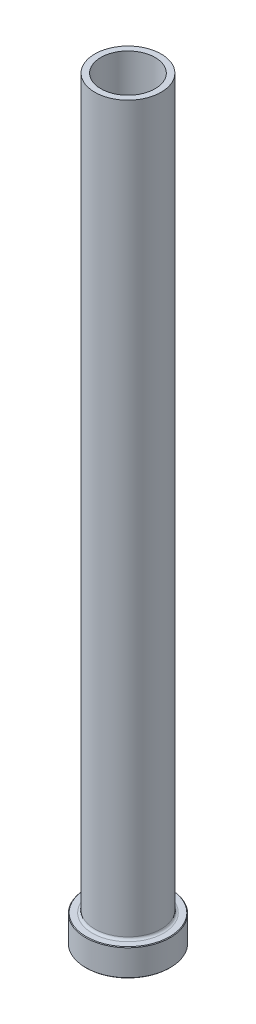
ISO-10303-21;
HEADER;
FILE_DESCRIPTION(('STEP AP214'),'2;1');
FILE_NAME('part.step','',(''),(''),'','','');
FILE_SCHEMA(('AUTOMOTIVE_DESIGN { 1 0 10303 214 1 1 1 1 }'));
ENDSEC;
DATA;
#1=APPLICATION_CONTEXT('core data for automotive mechanical design processes');
#2=APPLICATION_PROTOCOL_DEFINITION('international standard','automotive_design',2000,#1);
#3=PRODUCT_CONTEXT('',#1,'mechanical');
#4=PRODUCT('Part','Part','',(#3));
#5=PRODUCT_RELATED_PRODUCT_CATEGORY('part','',(#4));
#6=PRODUCT_DEFINITION_FORMATION('','',#4);
#7=PRODUCT_DEFINITION_CONTEXT('part definition',#1,'design');
#8=PRODUCT_DEFINITION('design','',#6,#7);
#9=PRODUCT_DEFINITION_SHAPE('','',#8);
#10=(LENGTH_UNIT() NAMED_UNIT(*) SI_UNIT(.MILLI.,.METRE.));
#11=(NAMED_UNIT(*) PLANE_ANGLE_UNIT() SI_UNIT($,.RADIAN.));
#12=(NAMED_UNIT(*) SI_UNIT($,.STERADIAN.) SOLID_ANGLE_UNIT());
#13=UNCERTAINTY_MEASURE_WITH_UNIT(LENGTH_MEASURE(1.E-05),#10,'distance_accuracy_value','');
#14=(GEOMETRIC_REPRESENTATION_CONTEXT(3) GLOBAL_UNCERTAINTY_ASSIGNED_CONTEXT((#13)) GLOBAL_UNIT_ASSIGNED_CONTEXT((#10,
#11,#12)) REPRESENTATION_CONTEXT('',''));
#15=CARTESIAN_POINT('',(0.,0.,0.));
#16=DIRECTION('',(0.,0.,1.));
#17=DIRECTION('',(1.,0.,0.));
#18=AXIS2_PLACEMENT_3D('',#15,#16,#17);
#19=CARTESIAN_POINT('',(0.,92.1876809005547,0.));
#20=DIRECTION('',(0.,1.,0.));
#21=DIRECTION('',(0.,0.,1.));
#22=AXIS2_PLACEMENT_3D('',#19,#20,#21);
#23=CYLINDRICAL_SURFACE('',#22,9.00000000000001);
#24=CARTESIAN_POINT('',(0.,250.,0.));
#25=DIRECTION('',(0.,1.,0.));
#26=DIRECTION('',(0.,0.,1.));
#27=AXIS2_PLACEMENT_3D('',#24,#25,#26);
#28=CIRCLE('',#27,9.00000000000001);
#29=CARTESIAN_POINT('',(0.,250.,9.00000000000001));
#30=VERTEX_POINT('',#29);
#31=EDGE_CURVE('E62',#30,#30,#28,.T.);
#32=ORIENTED_EDGE('',*,*,#31,.T.);
#33=EDGE_LOOP('',(#32));
#34=FACE_BOUND('',#33,.T.);
#35=CARTESIAN_POINT('',(0.,195.,0.));
#36=DIRECTION('',(0.,1.,0.));
#37=DIRECTION('',(0.,0.,1.));
#38=AXIS2_PLACEMENT_3D('',#35,#36,#37);
#39=CIRCLE('',#38,9.00000000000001);
#40=CARTESIAN_POINT('',(0.,195.,9.00000000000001));
#41=VERTEX_POINT('',#40);
#42=EDGE_CURVE('E71',#41,#41,#39,.T.);
#43=ORIENTED_EDGE('',*,*,#42,.F.);
#44=EDGE_LOOP('',(#43));
#45=FACE_BOUND('',#44,.T.);
#46=ADVANCED_FACE('F30',(#34,#45),#23,.F.);
#47=CARTESIAN_POINT('',(-9.00000000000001,250.,0.));
#48=DIRECTION('',(0.,1.,0.));
#49=DIRECTION('',(0.,0.,1.));
#50=AXIS2_PLACEMENT_3D('',#47,#48,#49);
#51=PLANE('',#50);
#52=CARTESIAN_POINT('',(0.,250.,0.));
#53=DIRECTION('',(0.,1.,0.));
#54=DIRECTION('',(0.,0.,1.));
#55=AXIS2_PLACEMENT_3D('',#52,#53,#54);
#56=CIRCLE('',#55,11.);
#57=CARTESIAN_POINT('',(0.,250.,11.));
#58=VERTEX_POINT('',#57);
#59=EDGE_CURVE('E65',#58,#58,#56,.T.);
#60=ORIENTED_EDGE('',*,*,#59,.T.);
#61=EDGE_LOOP('',(#60));
#62=FACE_BOUND('',#61,.T.);
#63=ORIENTED_EDGE('',*,*,#31,.F.);
#64=EDGE_LOOP('',(#63));
#65=FACE_BOUND('',#64,.T.);
#66=ADVANCED_FACE('F79',(#62,#65),#51,.T.);
#67=CARTESIAN_POINT('',(0.,92.1876809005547,0.));
#68=DIRECTION('',(0.,1.,0.));
#69=DIRECTION('',(0.,0.,1.));
#70=AXIS2_PLACEMENT_3D('',#67,#68,#69);
#71=CYLINDRICAL_SURFACE('',#70,11.);
#72=CARTESIAN_POINT('',(0.,9.8,0.));
#73=DIRECTION('',(0.,1.,0.));
#74=DIRECTION('',(0.,0.,1.));
#75=AXIS2_PLACEMENT_3D('',#72,#73,#74);
#76=CIRCLE('',#75,11.);
#77=CARTESIAN_POINT('',(0.,9.8,11.));
#78=VERTEX_POINT('',#77);
#79=EDGE_CURVE('E59',#78,#78,#76,.T.);
#80=ORIENTED_EDGE('',*,*,#79,.T.);
#81=EDGE_LOOP('',(#80));
#82=FACE_BOUND('',#81,.T.);
#83=ORIENTED_EDGE('',*,*,#59,.F.);
#84=EDGE_LOOP('',(#83));
#85=FACE_BOUND('',#84,.T.);
#86=ADVANCED_FACE('F85',(#82,#85),#71,.T.);
#87=CARTESIAN_POINT('',(-11.,9.,0.));
#88=DIRECTION('',(0.,1.,0.));
#89=DIRECTION('',(0.,0.,1.));
#90=AXIS2_PLACEMENT_3D('',#87,#88,#89);
#91=PLANE('',#90);
#92=CARTESIAN_POINT('',(0.,9.,0.));
#93=DIRECTION('',(0.,1.,0.));
#94=DIRECTION('',(0.,0.,1.));
#95=AXIS2_PLACEMENT_3D('',#92,#93,#94);
#96=CIRCLE('',#95,13.8000000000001);
#97=CARTESIAN_POINT('',(0.,9.,13.8000000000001));
#98=VERTEX_POINT('',#97);
#99=EDGE_CURVE('E53',#98,#98,#96,.T.);
#100=ORIENTED_EDGE('',*,*,#99,.T.);
#101=EDGE_LOOP('',(#100));
#102=FACE_BOUND('',#101,.T.);
#103=CARTESIAN_POINT('',(0.,9.,0.));
#104=DIRECTION('',(0.,1.,0.));
#105=DIRECTION('',(0.,0.,1.));
#106=AXIS2_PLACEMENT_3D('',#103,#104,#105);
#107=CIRCLE('',#106,11.8);
#108=CARTESIAN_POINT('',(0.,9.,11.8));
#109=VERTEX_POINT('',#108);
#110=EDGE_CURVE('E56',#109,#109,#107,.F.);
#111=ORIENTED_EDGE('',*,*,#110,.T.);
#112=EDGE_LOOP('',(#111));
#113=FACE_BOUND('',#112,.T.);
#114=ADVANCED_FACE('F111',(#102,#113),#91,.T.);
#115=CARTESIAN_POINT('',(0.,92.1876809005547,0.));
#116=DIRECTION('',(0.,1.,0.));
#117=DIRECTION('',(0.,0.,1.));
#118=AXIS2_PLACEMENT_3D('',#115,#116,#117);
#119=CYLINDRICAL_SURFACE('',#118,14.);
#120=CARTESIAN_POINT('',(0.,8.80000000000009,0.));
#121=DIRECTION('',(0.,1.,0.));
#122=DIRECTION('',(0.,0.,1.));
#123=AXIS2_PLACEMENT_3D('',#120,#121,#122);
#124=CIRCLE('',#123,14.);
#125=CARTESIAN_POINT('',(0.,8.80000000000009,14.));
#126=VERTEX_POINT('',#125);
#127=EDGE_CURVE('E45',#126,#126,#124,.F.);
#128=ORIENTED_EDGE('',*,*,#127,.T.);
#129=EDGE_LOOP('',(#128));
#130=FACE_BOUND('',#129,.T.);
#131=CARTESIAN_POINT('',(0.,0.200000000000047,0.));
#132=DIRECTION('',(0.,-1.,0.));
#133=DIRECTION('',(0.,0.,-1.));
#134=AXIS2_PLACEMENT_3D('',#131,#132,#133);
#135=CIRCLE('',#134,14.);
#136=CARTESIAN_POINT('',(0.,0.200000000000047,-14.));
#137=VERTEX_POINT('',#136);
#138=EDGE_CURVE('E50',#137,#137,#135,.F.);
#139=ORIENTED_EDGE('',*,*,#138,.T.);
#140=EDGE_LOOP('',(#139));
#141=FACE_BOUND('',#140,.T.);
#142=ADVANCED_FACE('F108',(#130,#141),#119,.T.);
#143=CARTESIAN_POINT('',(-14.,0.,0.));
#144=DIRECTION('',(0.,-1.,0.));
#145=DIRECTION('',(0.,0.,-1.));
#146=AXIS2_PLACEMENT_3D('',#143,#144,#145);
#147=PLANE('',#146);
#148=CARTESIAN_POINT('',(0.,0.,0.));
#149=DIRECTION('',(0.,-1.,0.));
#150=DIRECTION('',(0.,0.,-1.));
#151=AXIS2_PLACEMENT_3D('',#148,#149,#150);
#152=CIRCLE('',#151,9.75000000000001);
#153=CARTESIAN_POINT('',(0.,0.,-9.75000000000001));
#154=VERTEX_POINT('',#153);
#155=EDGE_CURVE('E37',#154,#154,#152,.F.);
#156=ORIENTED_EDGE('',*,*,#155,.T.);
#157=EDGE_LOOP('',(#156));
#158=FACE_BOUND('',#157,.T.);
#159=CARTESIAN_POINT('',(0.,0.,0.));
#160=DIRECTION('',(0.,-1.,0.));
#161=DIRECTION('',(0.,0.,-1.));
#162=AXIS2_PLACEMENT_3D('',#159,#160,#161);
#163=CIRCLE('',#162,13.8);
#164=CARTESIAN_POINT('',(0.,0.,-13.8));
#165=VERTEX_POINT('',#164);
#166=EDGE_CURVE('E41',#165,#165,#163,.T.);
#167=ORIENTED_EDGE('',*,*,#166,.T.);
#168=EDGE_LOOP('',(#167));
#169=FACE_BOUND('',#168,.T.);
#170=ADVANCED_FACE('F110',(#158,#169),#147,.T.);
#171=CARTESIAN_POINT('',(0.,92.1876809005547,0.));
#172=DIRECTION('',(0.,1.,0.));
#173=DIRECTION('',(0.,0.,1.));
#174=AXIS2_PLACEMENT_3D('',#171,#172,#173);
#175=CYLINDRICAL_SURFACE('',#174,9.25);
#176=CARTESIAN_POINT('',(0.,0.5,0.));
#177=DIRECTION('',(0.,-1.,0.));
#178=DIRECTION('',(0.,0.,-1.));
#179=AXIS2_PLACEMENT_3D('',#176,#177,#178);
#180=CIRCLE('',#179,9.25);
#181=CARTESIAN_POINT('',(0.,0.5,-9.25));
#182=VERTEX_POINT('',#181);
#183=EDGE_CURVE('E10',#182,#182,#180,.T.);
#184=ORIENTED_EDGE('',*,*,#183,.T.);
#185=EDGE_LOOP('',(#184));
#186=FACE_BOUND('',#185,.T.);
#187=CARTESIAN_POINT('',(0.,183.,0.));
#188=DIRECTION('',(0.,1.,0.));
#189=DIRECTION('',(0.,0.,1.));
#190=AXIS2_PLACEMENT_3D('',#187,#188,#189);
#191=CIRCLE('',#190,9.25000000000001);
#192=CARTESIAN_POINT('',(0.,183.,9.25000000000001));
#193=VERTEX_POINT('',#192);
#194=EDGE_CURVE('E68',#193,#193,#191,.T.);
#195=ORIENTED_EDGE('',*,*,#194,.T.);
#196=EDGE_LOOP('',(#195));
#197=FACE_BOUND('',#196,.T.);
#198=ADVANCED_FACE('F118',(#186,#197),#175,.F.);
#199=CARTESIAN_POINT('',(0.,183.,0.));
#200=DIRECTION('',(0.,-1.,0.));
#201=DIRECTION('',(0.,0.,-1.));
#202=AXIS2_PLACEMENT_3D('',#199,#200,#201);
#203=CONICAL_SURFACE('',#202,9.25000000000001,0.0208303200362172);
#204=ORIENTED_EDGE('',*,*,#42,.T.);
#205=EDGE_LOOP('',(#204));
#206=FACE_BOUND('',#205,.T.);
#207=ORIENTED_EDGE('',*,*,#194,.F.);
#208=EDGE_LOOP('',(#207));
#209=FACE_BOUND('',#208,.T.);
#210=ADVANCED_FACE('F75',(#206,#209),#203,.F.);
#211=CARTESIAN_POINT('',(0.,9.8,0.));
#212=DIRECTION('',(0.,1.,0.));
#213=DIRECTION('',(0.,0.,1.));
#214=AXIS2_PLACEMENT_3D('',#211,#212,#213);
#215=TOROIDAL_SURFACE('',#214,11.8,0.8);
#216=ORIENTED_EDGE('',*,*,#110,.F.);
#217=EDGE_LOOP('',(#216));
#218=FACE_BOUND('',#217,.T.);
#219=ORIENTED_EDGE('',*,*,#79,.F.);
#220=EDGE_LOOP('',(#219));
#221=FACE_BOUND('',#220,.T.);
#222=ADVANCED_FACE('F90',(#218,#221),#215,.F.);
#223=CARTESIAN_POINT('',(0.,8.99999999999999,0.));
#224=DIRECTION('',(0.,-1.,0.));
#225=DIRECTION('',(0.,0.,-1.));
#226=AXIS2_PLACEMENT_3D('',#223,#224,#225);
#227=CONICAL_SURFACE('',#226,13.8000000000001,0.785398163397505);
#228=ORIENTED_EDGE('',*,*,#127,.F.);
#229=EDGE_LOOP('',(#228));
#230=FACE_BOUND('',#229,.T.);
#231=ORIENTED_EDGE('',*,*,#99,.F.);
#232=EDGE_LOOP('',(#231));
#233=FACE_BOUND('',#232,.T.);
#234=ADVANCED_FACE('F93',(#230,#233),#227,.T.);
#235=CARTESIAN_POINT('',(0.,0.200000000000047,0.));
#236=DIRECTION('',(0.,1.,0.));
#237=DIRECTION('',(0.,0.,1.));
#238=AXIS2_PLACEMENT_3D('',#235,#236,#237);
#239=CONICAL_SURFACE('',#238,14.,0.785398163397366);
#240=ORIENTED_EDGE('',*,*,#166,.F.);
#241=EDGE_LOOP('',(#240));
#242=FACE_BOUND('',#241,.T.);
#243=ORIENTED_EDGE('',*,*,#138,.F.);
#244=EDGE_LOOP('',(#243));
#245=FACE_BOUND('',#244,.T.);
#246=ADVANCED_FACE('F96',(#242,#245),#239,.T.);
#247=CARTESIAN_POINT('',(0.,0.,0.));
#248=DIRECTION('',(0.,-1.,0.));
#249=DIRECTION('',(0.,0.,-1.));
#250=AXIS2_PLACEMENT_3D('',#247,#248,#249);
#251=CONICAL_SURFACE('',#250,9.75000000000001,0.785398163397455);
#252=ORIENTED_EDGE('',*,*,#183,.F.);
#253=EDGE_LOOP('',(#252));
#254=FACE_BOUND('',#253,.T.);
#255=ORIENTED_EDGE('',*,*,#155,.F.);
#256=EDGE_LOOP('',(#255));
#257=FACE_BOUND('',#256,.T.);
#258=ADVANCED_FACE('F32',(#254,#257),#251,.F.);
#259=CLOSED_SHELL('',(#46,#66,#86,#114,#142,#170,#198,#210,#222,#234,#246,#258));
#260=MANIFOLD_SOLID_BREP('B2',#259);
#261=ADVANCED_BREP_SHAPE_REPRESENTATION('',(#18,#260),#14);
#262=SHAPE_DEFINITION_REPRESENTATION(#9,#261);
ENDSEC;
END-ISO-10303-21;
